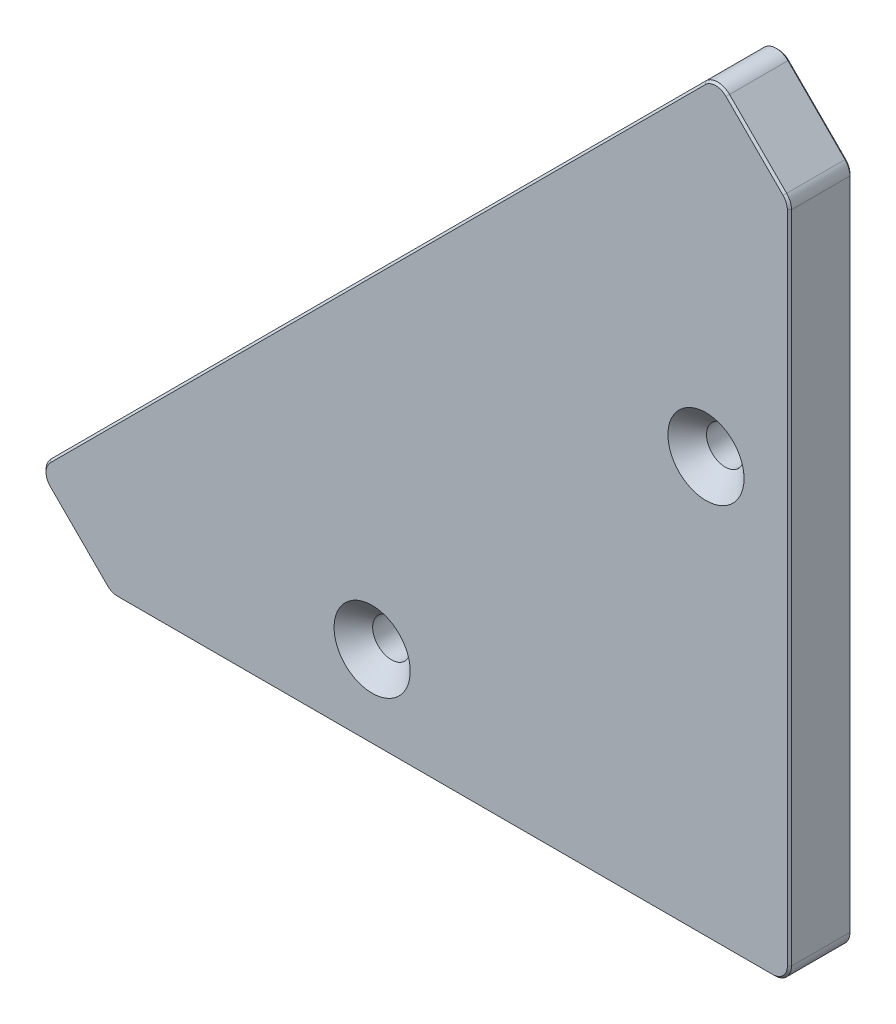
ISO-10303-21;
HEADER;
FILE_DESCRIPTION(('STEP AP214'),'2;1');
FILE_NAME('part.step','',(''),(''),'','','');
FILE_SCHEMA(('AUTOMOTIVE_DESIGN { 1 0 10303 214 1 1 1 1 }'));
ENDSEC;
DATA;
#1=APPLICATION_CONTEXT('core data for automotive mechanical design processes');
#2=APPLICATION_PROTOCOL_DEFINITION('international standard','automotive_design',2000,#1);
#3=PRODUCT_CONTEXT('',#1,'mechanical');
#4=PRODUCT('Part','Part','',(#3));
#5=PRODUCT_RELATED_PRODUCT_CATEGORY('part','',(#4));
#6=PRODUCT_DEFINITION_FORMATION('','',#4);
#7=PRODUCT_DEFINITION_CONTEXT('part definition',#1,'design');
#8=PRODUCT_DEFINITION('design','',#6,#7);
#9=PRODUCT_DEFINITION_SHAPE('','',#8);
#10=(LENGTH_UNIT() NAMED_UNIT(*) SI_UNIT(.MILLI.,.METRE.));
#11=(NAMED_UNIT(*) PLANE_ANGLE_UNIT() SI_UNIT($,.RADIAN.));
#12=(NAMED_UNIT(*) SI_UNIT($,.STERADIAN.) SOLID_ANGLE_UNIT());
#13=UNCERTAINTY_MEASURE_WITH_UNIT(LENGTH_MEASURE(1.E-05),#10,'distance_accuracy_value','');
#14=(GEOMETRIC_REPRESENTATION_CONTEXT(3) GLOBAL_UNCERTAINTY_ASSIGNED_CONTEXT((#13)) GLOBAL_UNIT_ASSIGNED_CONTEXT((#10,
#11,#12)) REPRESENTATION_CONTEXT('',''));
#15=CARTESIAN_POINT('',(0.,0.,0.));
#16=DIRECTION('',(0.,0.,1.));
#17=DIRECTION('',(1.,0.,0.));
#18=AXIS2_PLACEMENT_3D('',#15,#16,#17);
#19=CARTESIAN_POINT('',(0.,0.,15.));
#20=DIRECTION('',(0.,0.,-1.));
#21=DIRECTION('',(-1.,0.,0.));
#22=AXIS2_PLACEMENT_3D('',#19,#20,#21);
#23=PLANE('',#22);
#24=DIRECTION('',(-0.707106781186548,-0.707106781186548,0.));
#25=VECTOR('',#24,1.);
#26=CARTESIAN_POINT('',(-98.6413959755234,98.6413959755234,15.));
#27=LINE('',#26,#25);
#28=CARTESIAN_POINT('',(-20.1525432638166,177.13024868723,15.));
#29=VERTEX_POINT('',#28);
#30=CARTESIAN_POINT('',(-177.13024868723,20.1525432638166,15.));
#31=VERTEX_POINT('',#30);
#32=EDGE_CURVE('E369',#29,#31,#27,.T.);
#33=ORIENTED_EDGE('',*,*,#32,.T.);
#34=CARTESIAN_POINT('',(-174.655374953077,17.6776695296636,15.));
#35=DIRECTION('',(0.,0.,-1.));
#36=DIRECTION('',(-1.,0.,0.));
#37=AXIS2_PLACEMENT_3D('',#34,#35,#36);
#38=CIRCLE('',#37,3.50000000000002);
#39=CARTESIAN_POINT('',(-177.13024868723,15.2027957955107,15.));
#40=VERTEX_POINT('',#39);
#41=EDGE_CURVE('E377',#31,#40,#38,.F.);
#42=ORIENTED_EDGE('',*,*,#41,.T.);
#43=DIRECTION('',(0.707106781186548,-0.707106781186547,0.));
#44=VECTOR('',#43,1.);
#45=CARTESIAN_POINT('',(-80.9637264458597,-80.9637264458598,15.));
#46=LINE('',#45,#44);
#47=CARTESIAN_POINT('',(-163.452579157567,1.52512626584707,15.));
#48=VERTEX_POINT('',#47);
#49=EDGE_CURVE('E375',#40,#48,#46,.T.);
#50=ORIENTED_EDGE('',*,*,#49,.T.);
#51=CARTESIAN_POINT('',(-160.977705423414,4.,15.));
#52=DIRECTION('',(0.,0.,-1.));
#53=DIRECTION('',(-1.,0.,0.));
#54=AXIS2_PLACEMENT_3D('',#51,#52,#53);
#55=CIRCLE('',#54,3.50000000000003);
#56=CARTESIAN_POINT('',(-160.977705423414,0.499999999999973,15.));
#57=VERTEX_POINT('',#56);
#58=EDGE_CURVE('E367',#48,#57,#55,.F.);
#59=ORIENTED_EDGE('',*,*,#58,.T.);
#60=DIRECTION('',(1.,0.,0.));
#61=VECTOR('',#60,1.);
#62=CARTESIAN_POINT('',(0.,0.499999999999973,15.));
#63=LINE('',#62,#61);
#64=CARTESIAN_POINT('',(-4.,0.499999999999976,15.));
#65=VERTEX_POINT('',#64);
#66=EDGE_CURVE('E180',#57,#65,#63,.T.);
#67=ORIENTED_EDGE('',*,*,#66,.T.);
#68=CARTESIAN_POINT('',(-4.,4.,15.));
#69=DIRECTION('',(0.,0.,-1.));
#70=DIRECTION('',(-1.,0.,0.));
#71=AXIS2_PLACEMENT_3D('',#68,#69,#70);
#72=CIRCLE('',#71,3.50000000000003);
#73=CARTESIAN_POINT('',(-0.499999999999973,4.,15.));
#74=VERTEX_POINT('',#73);
#75=EDGE_CURVE('E174',#65,#74,#72,.F.);
#76=ORIENTED_EDGE('',*,*,#75,.T.);
#77=DIRECTION('',(0.,1.,0.));
#78=VECTOR('',#77,1.);
#79=CARTESIAN_POINT('',(-0.499999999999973,0.,15.));
#80=LINE('',#79,#78);
#81=CARTESIAN_POINT('',(-0.499999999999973,160.977705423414,15.));
#82=VERTEX_POINT('',#81);
#83=EDGE_CURVE('E177',#74,#82,#80,.T.);
#84=ORIENTED_EDGE('',*,*,#83,.T.);
#85=CARTESIAN_POINT('',(-4.,160.977705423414,15.));
#86=DIRECTION('',(0.,0.,-1.));
#87=DIRECTION('',(-1.,0.,0.));
#88=AXIS2_PLACEMENT_3D('',#85,#86,#87);
#89=CIRCLE('',#88,3.50000000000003);
#90=CARTESIAN_POINT('',(-1.52512626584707,163.452579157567,15.));
#91=VERTEX_POINT('',#90);
#92=EDGE_CURVE('E186',#82,#91,#89,.F.);
#93=ORIENTED_EDGE('',*,*,#92,.T.);
#94=DIRECTION('',(-0.707106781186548,0.707106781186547,0.));
#95=VECTOR('',#94,1.);
#96=CARTESIAN_POINT('',(80.9637264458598,80.9637264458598,15.));
#97=LINE('',#96,#95);
#98=CARTESIAN_POINT('',(-15.2027957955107,177.13024868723,15.));
#99=VERTEX_POINT('',#98);
#100=EDGE_CURVE('E185',#91,#99,#97,.T.);
#101=ORIENTED_EDGE('',*,*,#100,.T.);
#102=CARTESIAN_POINT('',(-17.6776695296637,174.655374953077,15.));
#103=DIRECTION('',(0.,0.,-1.));
#104=DIRECTION('',(-1.,0.,0.));
#105=AXIS2_PLACEMENT_3D('',#102,#103,#104);
#106=CIRCLE('',#105,3.50000000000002);
#107=EDGE_CURVE('E365',#99,#29,#106,.F.);
#108=ORIENTED_EDGE('',*,*,#107,.T.);
#109=EDGE_LOOP('',(#33,#42,#50,#59,#67,#76,#84,#93,#101,#108));
#110=FACE_BOUND('',#109,.T.);
#111=CARTESIAN_POINT('',(-20.,100.,15.));
#112=DIRECTION('',(0.,0.,1.));
#113=DIRECTION('',(1.,0.,0.));
#114=AXIS2_PLACEMENT_3D('',#111,#112,#113);
#115=CIRCLE('',#114,9.125);
#116=CARTESIAN_POINT('',(-10.875,100.,15.));
#117=VERTEX_POINT('',#116);
#118=EDGE_CURVE('E764',#117,#117,#115,.T.);
#119=ORIENTED_EDGE('',*,*,#118,.F.);
#120=EDGE_LOOP('',(#119));
#121=FACE_BOUND('',#120,.T.);
#122=CARTESIAN_POINT('',(-100.,20.,15.));
#123=DIRECTION('',(0.,0.,1.));
#124=DIRECTION('',(1.,0.,0.));
#125=AXIS2_PLACEMENT_3D('',#122,#123,#124);
#126=CIRCLE('',#125,9.12499999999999);
#127=CARTESIAN_POINT('',(-90.875,20.,15.));
#128=VERTEX_POINT('',#127);
#129=EDGE_CURVE('E203',#128,#128,#126,.T.);
#130=ORIENTED_EDGE('',*,*,#129,.F.);
#131=EDGE_LOOP('',(#130));
#132=FACE_BOUND('',#131,.T.);
#133=ADVANCED_FACE('F35',(#110,#121,#132),#23,.F.);
#134=CARTESIAN_POINT('',(0.,197.989898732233,15.));
#135=DIRECTION('',(-1.,0.,0.));
#136=DIRECTION('',(0.,0.,1.));
#137=AXIS2_PLACEMENT_3D('',#134,#135,#136);
#138=PLANE('',#137);
#139=DIRECTION('',(0.,0.,-1.));
#140=VECTOR('',#139,1.);
#141=CARTESIAN_POINT('',(0.,160.977705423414,15.));
#142=LINE('',#141,#140);
#143=CARTESIAN_POINT('',(0.,160.977705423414,0.499999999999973));
#144=VERTEX_POINT('',#143);
#145=CARTESIAN_POINT('',(0.,160.977705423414,14.5));
#146=VERTEX_POINT('',#145);
#147=EDGE_CURVE('E746',#144,#146,#142,.F.);
#148=ORIENTED_EDGE('',*,*,#147,.T.);
#149=DIRECTION('',(0.,-1.,0.));
#150=VECTOR('',#149,1.);
#151=CARTESIAN_POINT('',(0.,197.989898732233,14.5));
#152=LINE('',#151,#150);
#153=CARTESIAN_POINT('',(0.,4.,14.5));
#154=VERTEX_POINT('',#153);
#155=EDGE_CURVE('E292',#146,#154,#152,.T.);
#156=ORIENTED_EDGE('',*,*,#155,.T.);
#157=DIRECTION('',(0.,0.,-1.));
#158=VECTOR('',#157,1.);
#159=CARTESIAN_POINT('',(0.,4.,15.));
#160=LINE('',#159,#158);
#161=CARTESIAN_POINT('',(0.,4.,0.499999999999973));
#162=VERTEX_POINT('',#161);
#163=EDGE_CURVE('E748',#154,#162,#160,.T.);
#164=ORIENTED_EDGE('',*,*,#163,.T.);
#165=DIRECTION('',(0.,1.,0.));
#166=VECTOR('',#165,1.);
#167=CARTESIAN_POINT('',(0.,160.977705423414,0.499999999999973));
#168=LINE('',#167,#166);
#169=EDGE_CURVE('E290',#162,#144,#168,.T.);
#170=ORIENTED_EDGE('',*,*,#169,.T.);
#171=EDGE_LOOP('',(#148,#156,#164,#170));
#172=FACE_BOUND('',#171,.T.);
#173=ADVANCED_FACE('F415',(#172),#138,.F.);
#174=CARTESIAN_POINT('',(-197.989898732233,0.,15.));
#175=DIRECTION('',(0.707106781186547,-0.707106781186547,0.));
#176=DIRECTION('',(0.707106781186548,0.707106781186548,0.));
#177=AXIS2_PLACEMENT_3D('',#174,#175,#176);
#178=PLANE('',#177);
#179=DIRECTION('',(0.,0.,-1.));
#180=VECTOR('',#179,1.);
#181=CARTESIAN_POINT('',(-177.483802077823,20.5060966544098,15.));
#182=LINE('',#181,#180);
#183=CARTESIAN_POINT('',(-177.483802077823,20.5060966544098,0.499999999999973));
#184=VERTEX_POINT('',#183);
#185=CARTESIAN_POINT('',(-177.483802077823,20.5060966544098,14.5));
#186=VERTEX_POINT('',#185);
#187=EDGE_CURVE('E747',#184,#186,#182,.F.);
#188=ORIENTED_EDGE('',*,*,#187,.T.);
#189=DIRECTION('',(0.707106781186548,0.707106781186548,0.));
#190=VECTOR('',#189,1.);
#191=CARTESIAN_POINT('',(-197.989898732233,0.,14.5));
#192=LINE('',#191,#190);
#193=CARTESIAN_POINT('',(-20.5060966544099,177.483802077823,14.5));
#194=VERTEX_POINT('',#193);
#195=EDGE_CURVE('E326',#186,#194,#192,.T.);
#196=ORIENTED_EDGE('',*,*,#195,.T.);
#197=DIRECTION('',(0.,0.,-1.));
#198=VECTOR('',#197,1.);
#199=CARTESIAN_POINT('',(-20.5060966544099,177.483802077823,15.));
#200=LINE('',#199,#198);
#201=CARTESIAN_POINT('',(-20.5060966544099,177.483802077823,0.499999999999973));
#202=VERTEX_POINT('',#201);
#203=EDGE_CURVE('E346',#194,#202,#200,.T.);
#204=ORIENTED_EDGE('',*,*,#203,.T.);
#205=DIRECTION('',(-0.707106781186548,-0.707106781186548,0.));
#206=VECTOR('',#205,1.);
#207=CARTESIAN_POINT('',(-177.483802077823,20.5060966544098,0.499999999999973));
#208=LINE('',#207,#206);
#209=EDGE_CURVE('E321',#202,#184,#208,.T.);
#210=ORIENTED_EDGE('',*,*,#209,.T.);
#211=EDGE_LOOP('',(#188,#196,#204,#210));
#212=FACE_BOUND('',#211,.T.);
#213=ADVANCED_FACE('F420',(#212),#178,.F.);
#214=CARTESIAN_POINT('',(0.,0.,15.));
#215=DIRECTION('',(0.,1.,0.));
#216=DIRECTION('',(0.,0.,1.));
#217=AXIS2_PLACEMENT_3D('',#214,#215,#216);
#218=PLANE('',#217);
#219=DIRECTION('',(0.,0.,-1.));
#220=VECTOR('',#219,1.);
#221=CARTESIAN_POINT('',(-4.,0.,15.));
#222=LINE('',#221,#220);
#223=CARTESIAN_POINT('',(-4.,0.,0.499999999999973));
#224=VERTEX_POINT('',#223);
#225=CARTESIAN_POINT('',(-4.,0.,14.5));
#226=VERTEX_POINT('',#225);
#227=EDGE_CURVE('E736',#224,#226,#222,.F.);
#228=ORIENTED_EDGE('',*,*,#227,.T.);
#229=DIRECTION('',(-1.,0.,0.));
#230=VECTOR('',#229,1.);
#231=CARTESIAN_POINT('',(0.,0.,14.5));
#232=LINE('',#231,#230);
#233=CARTESIAN_POINT('',(-160.977705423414,0.,14.5));
#234=VERTEX_POINT('',#233);
#235=EDGE_CURVE('E267',#226,#234,#232,.T.);
#236=ORIENTED_EDGE('',*,*,#235,.T.);
#237=DIRECTION('',(0.,0.,-1.));
#238=VECTOR('',#237,1.);
#239=CARTESIAN_POINT('',(-160.977705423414,0.,15.));
#240=LINE('',#239,#238);
#241=CARTESIAN_POINT('',(-160.977705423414,0.,0.499999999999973));
#242=VERTEX_POINT('',#241);
#243=EDGE_CURVE('E197',#234,#242,#240,.T.);
#244=ORIENTED_EDGE('',*,*,#243,.T.);
#245=DIRECTION('',(1.,0.,0.));
#246=VECTOR('',#245,1.);
#247=CARTESIAN_POINT('',(-4.,0.,0.499999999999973));
#248=LINE('',#247,#246);
#249=EDGE_CURVE('E274',#242,#224,#248,.T.);
#250=ORIENTED_EDGE('',*,*,#249,.T.);
#251=EDGE_LOOP('',(#228,#236,#244,#250));
#252=FACE_BOUND('',#251,.T.);
#253=ADVANCED_FACE('F428',(#252),#218,.F.);
#254=CARTESIAN_POINT('',(0.,0.,0.));
#255=DIRECTION('',(0.,0.,-1.));
#256=DIRECTION('',(-1.,0.,0.));
#257=AXIS2_PLACEMENT_3D('',#254,#255,#256);
#258=PLANE('',#257);
#259=DIRECTION('',(-0.707106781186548,0.707106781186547,0.));
#260=VECTOR('',#259,1.);
#261=CARTESIAN_POINT('',(-177.13024868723,15.2027957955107,0.));
#262=LINE('',#261,#260);
#263=CARTESIAN_POINT('',(-163.452579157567,1.52512626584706,0.));
#264=VERTEX_POINT('',#263);
#265=CARTESIAN_POINT('',(-177.13024868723,15.2027957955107,0.));
#266=VERTEX_POINT('',#265);
#267=EDGE_CURVE('E44',#264,#266,#262,.T.);
#268=ORIENTED_EDGE('',*,*,#267,.T.);
#269=CARTESIAN_POINT('',(-174.655374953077,17.6776695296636,0.));
#270=DIRECTION('',(0.,0.,-1.));
#271=DIRECTION('',(-1.,0.,0.));
#272=AXIS2_PLACEMENT_3D('',#269,#270,#271);
#273=CIRCLE('',#272,3.50000000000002);
#274=CARTESIAN_POINT('',(-177.13024868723,20.1525432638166,0.));
#275=VERTEX_POINT('',#274);
#276=EDGE_CURVE('E11',#266,#275,#273,.T.);
#277=ORIENTED_EDGE('',*,*,#276,.T.);
#278=DIRECTION('',(0.707106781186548,0.707106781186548,0.));
#279=VECTOR('',#278,1.);
#280=CARTESIAN_POINT('',(-20.1525432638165,177.13024868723,0.));
#281=LINE('',#280,#279);
#282=CARTESIAN_POINT('',(-20.1525432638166,177.13024868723,0.));
#283=VERTEX_POINT('',#282);
#284=EDGE_CURVE('E308',#275,#283,#281,.T.);
#285=ORIENTED_EDGE('',*,*,#284,.T.);
#286=CARTESIAN_POINT('',(-17.6776695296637,174.655374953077,0.));
#287=DIRECTION('',(0.,0.,-1.));
#288=DIRECTION('',(-1.,0.,0.));
#289=AXIS2_PLACEMENT_3D('',#286,#287,#288);
#290=CIRCLE('',#289,3.50000000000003);
#291=CARTESIAN_POINT('',(-15.2027957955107,177.13024868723,0.));
#292=VERTEX_POINT('',#291);
#293=EDGE_CURVE('E304',#283,#292,#290,.T.);
#294=ORIENTED_EDGE('',*,*,#293,.T.);
#295=DIRECTION('',(0.707106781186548,-0.707106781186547,0.));
#296=VECTOR('',#295,1.);
#297=CARTESIAN_POINT('',(-1.52512626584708,163.452579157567,0.));
#298=LINE('',#297,#296);
#299=CARTESIAN_POINT('',(-1.52512626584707,163.452579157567,0.));
#300=VERTEX_POINT('',#299);
#301=EDGE_CURVE('E300',#292,#300,#298,.T.);
#302=ORIENTED_EDGE('',*,*,#301,.T.);
#303=CARTESIAN_POINT('',(-4.,160.977705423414,0.));
#304=DIRECTION('',(0.,0.,-1.));
#305=DIRECTION('',(-1.,0.,0.));
#306=AXIS2_PLACEMENT_3D('',#303,#304,#305);
#307=CIRCLE('',#306,3.50000000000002);
#308=CARTESIAN_POINT('',(-0.499999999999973,160.977705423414,0.));
#309=VERTEX_POINT('',#308);
#310=EDGE_CURVE('E296',#300,#309,#307,.T.);
#311=ORIENTED_EDGE('',*,*,#310,.T.);
#312=DIRECTION('',(0.,-1.,0.));
#313=VECTOR('',#312,1.);
#314=CARTESIAN_POINT('',(-0.499999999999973,4.,0.));
#315=LINE('',#314,#313);
#316=CARTESIAN_POINT('',(-0.499999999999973,4.,0.));
#317=VERTEX_POINT('',#316);
#318=EDGE_CURVE('E294',#309,#317,#315,.T.);
#319=ORIENTED_EDGE('',*,*,#318,.T.);
#320=CARTESIAN_POINT('',(-4.,4.,0.));
#321=DIRECTION('',(0.,0.,-1.));
#322=DIRECTION('',(-1.,0.,0.));
#323=AXIS2_PLACEMENT_3D('',#320,#321,#322);
#324=CIRCLE('',#323,3.50000000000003);
#325=CARTESIAN_POINT('',(-4.,0.499999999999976,0.));
#326=VERTEX_POINT('',#325);
#327=EDGE_CURVE('E298',#317,#326,#324,.T.);
#328=ORIENTED_EDGE('',*,*,#327,.T.);
#329=DIRECTION('',(-1.,0.,0.));
#330=VECTOR('',#329,1.);
#331=CARTESIAN_POINT('',(-160.977705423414,0.499999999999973,0.));
#332=LINE('',#331,#330);
#333=CARTESIAN_POINT('',(-160.977705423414,0.499999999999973,0.));
#334=VERTEX_POINT('',#333);
#335=EDGE_CURVE('E302',#326,#334,#332,.T.);
#336=ORIENTED_EDGE('',*,*,#335,.T.);
#337=CARTESIAN_POINT('',(-160.977705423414,4.,0.));
#338=DIRECTION('',(0.,0.,-1.));
#339=DIRECTION('',(-1.,0.,0.));
#340=AXIS2_PLACEMENT_3D('',#337,#338,#339);
#341=CIRCLE('',#340,3.50000000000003);
#342=EDGE_CURVE('E306',#334,#264,#341,.T.);
#343=ORIENTED_EDGE('',*,*,#342,.T.);
#344=EDGE_LOOP('',(#268,#277,#285,#294,#302,#311,#319,#328,#336,#343));
#345=FACE_BOUND('',#344,.T.);
#346=CARTESIAN_POINT('',(-100.,20.,0.));
#347=DIRECTION('',(0.,0.,1.));
#348=DIRECTION('',(1.,0.,0.));
#349=AXIS2_PLACEMENT_3D('',#346,#347,#348);
#350=CIRCLE('',#349,4.5);
#351=CARTESIAN_POINT('',(-95.5,20.,0.));
#352=VERTEX_POINT('',#351);
#353=EDGE_CURVE('E767',#352,#352,#350,.T.);
#354=ORIENTED_EDGE('',*,*,#353,.T.);
#355=EDGE_LOOP('',(#354));
#356=FACE_BOUND('',#355,.T.);
#357=CARTESIAN_POINT('',(-20.,100.,0.));
#358=DIRECTION('',(0.,0.,1.));
#359=DIRECTION('',(1.,0.,0.));
#360=AXIS2_PLACEMENT_3D('',#357,#358,#359);
#361=CIRCLE('',#360,4.5);
#362=CARTESIAN_POINT('',(-15.5,100.,0.));
#363=VERTEX_POINT('',#362);
#364=EDGE_CURVE('E356',#363,#363,#361,.T.);
#365=ORIENTED_EDGE('',*,*,#364,.T.);
#366=EDGE_LOOP('',(#365));
#367=FACE_BOUND('',#366,.T.);
#368=ADVANCED_FACE('F310',(#345,#356,#367),#258,.T.);
#369=CARTESIAN_POINT('',(-162.634559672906,0.,15.));
#370=DIRECTION('',(0.707106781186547,0.707106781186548,0.));
#371=DIRECTION('',(-0.707106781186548,0.707106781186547,0.));
#372=AXIS2_PLACEMENT_3D('',#369,#370,#371);
#373=PLANE('',#372);
#374=DIRECTION('',(0.,0.,-1.));
#375=VECTOR('',#374,1.);
#376=CARTESIAN_POINT('',(-163.80613254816,1.17157287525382,15.));
#377=LINE('',#376,#375);
#378=CARTESIAN_POINT('',(-163.80613254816,1.17157287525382,0.499999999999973));
#379=VERTEX_POINT('',#378);
#380=CARTESIAN_POINT('',(-163.80613254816,1.17157287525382,14.5));
#381=VERTEX_POINT('',#380);
#382=EDGE_CURVE('E391',#379,#381,#377,.F.);
#383=ORIENTED_EDGE('',*,*,#382,.T.);
#384=DIRECTION('',(-0.707106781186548,0.707106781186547,0.));
#385=VECTOR('',#384,1.);
#386=CARTESIAN_POINT('',(-162.634559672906,0.,14.5));
#387=LINE('',#386,#385);
#388=CARTESIAN_POINT('',(-177.483802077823,14.8492424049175,14.5));
#389=VERTEX_POINT('',#388);
#390=EDGE_CURVE('E327',#381,#389,#387,.T.);
#391=ORIENTED_EDGE('',*,*,#390,.T.);
#392=DIRECTION('',(0.,0.,-1.));
#393=VECTOR('',#392,1.);
#394=CARTESIAN_POINT('',(-177.483802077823,14.8492424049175,15.));
#395=LINE('',#394,#393);
#396=CARTESIAN_POINT('',(-177.483802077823,14.8492424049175,0.499999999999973));
#397=VERTEX_POINT('',#396);
#398=EDGE_CURVE('E394',#389,#397,#395,.T.);
#399=ORIENTED_EDGE('',*,*,#398,.T.);
#400=DIRECTION('',(0.707106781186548,-0.707106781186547,0.));
#401=VECTOR('',#400,1.);
#402=CARTESIAN_POINT('',(-163.80613254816,1.17157287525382,0.499999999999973));
#403=LINE('',#402,#401);
#404=EDGE_CURVE('E331',#397,#379,#403,.T.);
#405=ORIENTED_EDGE('',*,*,#404,.T.);
#406=EDGE_LOOP('',(#383,#391,#399,#405));
#407=FACE_BOUND('',#406,.T.);
#408=ADVANCED_FACE('F390',(#407),#373,.F.);
#409=CARTESIAN_POINT('',(0.,162.634559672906,15.));
#410=DIRECTION('',(-0.707106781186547,-0.707106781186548,0.));
#411=DIRECTION('',(0.707106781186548,-0.707106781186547,0.));
#412=AXIS2_PLACEMENT_3D('',#409,#410,#411);
#413=PLANE('',#412);
#414=DIRECTION('',(0.,0.,-1.));
#415=VECTOR('',#414,1.);
#416=CARTESIAN_POINT('',(-14.8492424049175,177.483802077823,15.));
#417=LINE('',#416,#415);
#418=CARTESIAN_POINT('',(-14.8492424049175,177.483802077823,0.499999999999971));
#419=VERTEX_POINT('',#418);
#420=CARTESIAN_POINT('',(-14.8492424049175,177.483802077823,14.5));
#421=VERTEX_POINT('',#420);
#422=EDGE_CURVE('E345',#419,#421,#417,.F.);
#423=ORIENTED_EDGE('',*,*,#422,.T.);
#424=DIRECTION('',(0.707106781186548,-0.707106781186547,0.));
#425=VECTOR('',#424,1.);
#426=CARTESIAN_POINT('',(0.,162.634559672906,14.5));
#427=LINE('',#426,#425);
#428=CARTESIAN_POINT('',(-1.17157287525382,163.80613254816,14.5));
#429=VERTEX_POINT('',#428);
#430=EDGE_CURVE('E276',#421,#429,#427,.T.);
#431=ORIENTED_EDGE('',*,*,#430,.T.);
#432=DIRECTION('',(0.,0.,-1.));
#433=VECTOR('',#432,1.);
#434=CARTESIAN_POINT('',(-1.17157287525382,163.80613254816,15.));
#435=LINE('',#434,#433);
#436=CARTESIAN_POINT('',(-1.17157287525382,163.80613254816,0.499999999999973));
#437=VERTEX_POINT('',#436);
#438=EDGE_CURVE('E355',#429,#437,#435,.T.);
#439=ORIENTED_EDGE('',*,*,#438,.T.);
#440=DIRECTION('',(-0.707106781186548,0.707106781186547,0.));
#441=VECTOR('',#440,1.);
#442=CARTESIAN_POINT('',(-14.8492424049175,177.483802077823,0.499999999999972));
#443=LINE('',#442,#441);
#444=EDGE_CURVE('E273',#437,#419,#443,.T.);
#445=ORIENTED_EDGE('',*,*,#444,.T.);
#446=EDGE_LOOP('',(#423,#431,#439,#445));
#447=FACE_BOUND('',#446,.T.);
#448=ADVANCED_FACE('F351',(#447),#413,.F.);
#449=CARTESIAN_POINT('',(-4.,160.977705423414,15.));
#450=DIRECTION('',(0.,0.,-1.));
#451=DIRECTION('',(-1.,0.,0.));
#452=AXIS2_PLACEMENT_3D('',#449,#450,#451);
#453=CYLINDRICAL_SURFACE('',#452,4.);
#454=ORIENTED_EDGE('',*,*,#438,.F.);
#455=CARTESIAN_POINT('',(-4.,160.977705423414,14.5));
#456=DIRECTION('',(0.,0.,-1.));
#457=DIRECTION('',(-1.,0.,0.));
#458=AXIS2_PLACEMENT_3D('',#455,#456,#457);
#459=CIRCLE('',#458,4.);
#460=EDGE_CURVE('E288',#429,#146,#459,.T.);
#461=ORIENTED_EDGE('',*,*,#460,.T.);
#462=ORIENTED_EDGE('',*,*,#147,.F.);
#463=CARTESIAN_POINT('',(-4.,160.977705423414,0.499999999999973));
#464=DIRECTION('',(0.,0.,-1.));
#465=DIRECTION('',(-1.,0.,0.));
#466=AXIS2_PLACEMENT_3D('',#463,#464,#465);
#467=CIRCLE('',#466,4.);
#468=EDGE_CURVE('E286',#144,#437,#467,.F.);
#469=ORIENTED_EDGE('',*,*,#468,.T.);
#470=EDGE_LOOP('',(#454,#461,#462,#469));
#471=FACE_BOUND('',#470,.T.);
#472=ADVANCED_FACE('F433',(#471),#453,.T.);
#473=CARTESIAN_POINT('',(-17.6776695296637,174.655374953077,15.));
#474=DIRECTION('',(0.,0.,-1.));
#475=DIRECTION('',(-1.,0.,0.));
#476=AXIS2_PLACEMENT_3D('',#473,#474,#475);
#477=CYLINDRICAL_SURFACE('',#476,4.);
#478=ORIENTED_EDGE('',*,*,#203,.F.);
#479=CARTESIAN_POINT('',(-17.6776695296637,174.655374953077,14.5));
#480=DIRECTION('',(0.,0.,-1.));
#481=DIRECTION('',(-1.,0.,0.));
#482=AXIS2_PLACEMENT_3D('',#479,#480,#481);
#483=CIRCLE('',#482,4.);
#484=EDGE_CURVE('E278',#194,#421,#483,.T.);
#485=ORIENTED_EDGE('',*,*,#484,.T.);
#486=ORIENTED_EDGE('',*,*,#422,.F.);
#487=CARTESIAN_POINT('',(-17.6776695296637,174.655374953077,0.499999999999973));
#488=DIRECTION('',(0.,0.,-1.));
#489=DIRECTION('',(-1.,0.,0.));
#490=AXIS2_PLACEMENT_3D('',#487,#488,#489);
#491=CIRCLE('',#490,4.);
#492=EDGE_CURVE('E338',#419,#202,#491,.F.);
#493=ORIENTED_EDGE('',*,*,#492,.T.);
#494=EDGE_LOOP('',(#478,#485,#486,#493));
#495=FACE_BOUND('',#494,.T.);
#496=ADVANCED_FACE('F344',(#495),#477,.T.);
#497=CARTESIAN_POINT('',(-174.655374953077,17.6776695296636,15.));
#498=DIRECTION('',(0.,0.,-1.));
#499=DIRECTION('',(-1.,0.,0.));
#500=AXIS2_PLACEMENT_3D('',#497,#498,#499);
#501=CYLINDRICAL_SURFACE('',#500,4.);
#502=ORIENTED_EDGE('',*,*,#398,.F.);
#503=CARTESIAN_POINT('',(-174.655374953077,17.6776695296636,14.5));
#504=DIRECTION('',(0.,0.,-1.));
#505=DIRECTION('',(-1.,0.,0.));
#506=AXIS2_PLACEMENT_3D('',#503,#504,#505);
#507=CIRCLE('',#506,4.);
#508=EDGE_CURVE('E383',#389,#186,#507,.T.);
#509=ORIENTED_EDGE('',*,*,#508,.T.);
#510=ORIENTED_EDGE('',*,*,#187,.F.);
#511=CARTESIAN_POINT('',(-174.655374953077,17.6776695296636,0.499999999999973));
#512=DIRECTION('',(0.,0.,-1.));
#513=DIRECTION('',(-1.,0.,0.));
#514=AXIS2_PLACEMENT_3D('',#511,#512,#513);
#515=CIRCLE('',#514,4.);
#516=EDGE_CURVE('E380',#184,#397,#515,.F.);
#517=ORIENTED_EDGE('',*,*,#516,.T.);
#518=EDGE_LOOP('',(#502,#509,#510,#517));
#519=FACE_BOUND('',#518,.T.);
#520=ADVANCED_FACE('F439',(#519),#501,.T.);
#521=CARTESIAN_POINT('',(-160.977705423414,4.,15.));
#522=DIRECTION('',(0.,0.,-1.));
#523=DIRECTION('',(-1.,0.,0.));
#524=AXIS2_PLACEMENT_3D('',#521,#522,#523);
#525=CYLINDRICAL_SURFACE('',#524,4.);
#526=ORIENTED_EDGE('',*,*,#243,.F.);
#527=CARTESIAN_POINT('',(-160.977705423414,4.,14.5));
#528=DIRECTION('',(0.,0.,-1.));
#529=DIRECTION('',(-1.,0.,0.));
#530=AXIS2_PLACEMENT_3D('',#527,#528,#529);
#531=CIRCLE('',#530,4.);
#532=EDGE_CURVE('E336',#234,#381,#531,.T.);
#533=ORIENTED_EDGE('',*,*,#532,.T.);
#534=ORIENTED_EDGE('',*,*,#382,.F.);
#535=CARTESIAN_POINT('',(-160.977705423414,4.,0.499999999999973));
#536=DIRECTION('',(0.,0.,-1.));
#537=DIRECTION('',(-1.,0.,0.));
#538=AXIS2_PLACEMENT_3D('',#535,#536,#537);
#539=CIRCLE('',#538,4.);
#540=EDGE_CURVE('E329',#379,#242,#539,.F.);
#541=ORIENTED_EDGE('',*,*,#540,.T.);
#542=EDGE_LOOP('',(#526,#533,#534,#541));
#543=FACE_BOUND('',#542,.T.);
#544=ADVANCED_FACE('F398',(#543),#525,.T.);
#545=CARTESIAN_POINT('',(-4.,4.,15.));
#546=DIRECTION('',(0.,0.,-1.));
#547=DIRECTION('',(-1.,0.,0.));
#548=AXIS2_PLACEMENT_3D('',#545,#546,#547);
#549=CYLINDRICAL_SURFACE('',#548,4.);
#550=ORIENTED_EDGE('',*,*,#163,.F.);
#551=CARTESIAN_POINT('',(-4.,4.,14.5));
#552=DIRECTION('',(0.,0.,-1.));
#553=DIRECTION('',(-1.,0.,0.));
#554=AXIS2_PLACEMENT_3D('',#551,#552,#553);
#555=CIRCLE('',#554,4.);
#556=EDGE_CURVE('E200',#154,#226,#555,.T.);
#557=ORIENTED_EDGE('',*,*,#556,.T.);
#558=ORIENTED_EDGE('',*,*,#227,.F.);
#559=CARTESIAN_POINT('',(-4.,4.,0.499999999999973));
#560=DIRECTION('',(0.,0.,-1.));
#561=DIRECTION('',(-1.,0.,0.));
#562=AXIS2_PLACEMENT_3D('',#559,#560,#561);
#563=CIRCLE('',#562,4.);
#564=EDGE_CURVE('E283',#224,#162,#563,.F.);
#565=ORIENTED_EDGE('',*,*,#564,.T.);
#566=EDGE_LOOP('',(#550,#557,#558,#565));
#567=FACE_BOUND('',#566,.T.);
#568=ADVANCED_FACE('F445',(#567),#549,.T.);
#569=CARTESIAN_POINT('',(-20.,100.,15.));
#570=DIRECTION('',(0.,0.,1.));
#571=DIRECTION('',(1.,0.,0.));
#572=AXIS2_PLACEMENT_3D('',#569,#570,#571);
#573=CYLINDRICAL_SURFACE('',#572,4.5);
#574=ORIENTED_EDGE('',*,*,#364,.F.);
#575=EDGE_LOOP('',(#574));
#576=FACE_BOUND('',#575,.T.);
#577=CARTESIAN_POINT('',(-20.,100.,10.375));
#578=DIRECTION('',(0.,0.,1.));
#579=DIRECTION('',(1.,0.,0.));
#580=AXIS2_PLACEMENT_3D('',#577,#578,#579);
#581=CIRCLE('',#580,4.5);
#582=CARTESIAN_POINT('',(-15.5,100.,10.375));
#583=VERTEX_POINT('',#582);
#584=EDGE_CURVE('E761',#583,#583,#581,.T.);
#585=ORIENTED_EDGE('',*,*,#584,.T.);
#586=EDGE_LOOP('',(#585));
#587=FACE_BOUND('',#586,.T.);
#588=ADVANCED_FACE('F448',(#576,#587),#573,.F.);
#589=CARTESIAN_POINT('',(-20.,100.,15.));
#590=DIRECTION('',(0.,0.,1.));
#591=DIRECTION('',(1.,0.,0.));
#592=AXIS2_PLACEMENT_3D('',#589,#590,#591);
#593=CONICAL_SURFACE('',#592,9.125,0.785398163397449);
#594=ORIENTED_EDGE('',*,*,#584,.F.);
#595=EDGE_LOOP('',(#594));
#596=FACE_BOUND('',#595,.T.);
#597=ORIENTED_EDGE('',*,*,#118,.T.);
#598=EDGE_LOOP('',(#597));
#599=FACE_BOUND('',#598,.T.);
#600=ADVANCED_FACE('F487',(#596,#599),#593,.F.);
#601=CARTESIAN_POINT('',(-100.,20.,15.));
#602=DIRECTION('',(0.,0.,1.));
#603=DIRECTION('',(1.,0.,0.));
#604=AXIS2_PLACEMENT_3D('',#601,#602,#603);
#605=CYLINDRICAL_SURFACE('',#604,4.5);
#606=ORIENTED_EDGE('',*,*,#353,.F.);
#607=EDGE_LOOP('',(#606));
#608=FACE_BOUND('',#607,.T.);
#609=CARTESIAN_POINT('',(-100.,20.,10.375));
#610=DIRECTION('',(0.,0.,1.));
#611=DIRECTION('',(1.,0.,0.));
#612=AXIS2_PLACEMENT_3D('',#609,#610,#611);
#613=CIRCLE('',#612,4.5);
#614=CARTESIAN_POINT('',(-95.5,20.,10.375));
#615=VERTEX_POINT('',#614);
#616=EDGE_CURVE('E770',#615,#615,#613,.T.);
#617=ORIENTED_EDGE('',*,*,#616,.T.);
#618=EDGE_LOOP('',(#617));
#619=FACE_BOUND('',#618,.T.);
#620=ADVANCED_FACE('F481',(#608,#619),#605,.F.);
#621=CARTESIAN_POINT('',(-100.,20.,15.));
#622=DIRECTION('',(0.,0.,1.));
#623=DIRECTION('',(1.,0.,0.));
#624=AXIS2_PLACEMENT_3D('',#621,#622,#623);
#625=CONICAL_SURFACE('',#624,9.12499999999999,0.785398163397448);
#626=ORIENTED_EDGE('',*,*,#616,.F.);
#627=EDGE_LOOP('',(#626));
#628=FACE_BOUND('',#627,.T.);
#629=ORIENTED_EDGE('',*,*,#129,.T.);
#630=EDGE_LOOP('',(#629));
#631=FACE_BOUND('',#630,.T.);
#632=ADVANCED_FACE('F477',(#628,#631),#625,.F.);
#633=CARTESIAN_POINT('',(-0.499999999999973,0.,15.));
#634=DIRECTION('',(-0.707106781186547,0.,-0.707106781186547));
#635=DIRECTION('',(0.,1.,0.));
#636=AXIS2_PLACEMENT_3D('',#633,#634,#635);
#637=PLANE('',#636);
#638=DIRECTION('',(-0.707106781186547,0.,0.707106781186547));
#639=VECTOR('',#638,1.);
#640=CARTESIAN_POINT('',(0.,4.,14.5));
#641=LINE('',#640,#639);
#642=EDGE_CURVE('E192',#154,#74,#641,.T.);
#643=ORIENTED_EDGE('',*,*,#642,.F.);
#644=ORIENTED_EDGE('',*,*,#155,.F.);
#645=DIRECTION('',(0.707106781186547,0.,-0.707106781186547));
#646=VECTOR('',#645,1.);
#647=CARTESIAN_POINT('',(-0.499999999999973,160.977705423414,15.));
#648=LINE('',#647,#646);
#649=EDGE_CURVE('E195',#82,#146,#648,.T.);
#650=ORIENTED_EDGE('',*,*,#649,.F.);
#651=ORIENTED_EDGE('',*,*,#83,.F.);
#652=EDGE_LOOP('',(#643,#644,#650,#651));
#653=FACE_BOUND('',#652,.T.);
#654=ADVANCED_FACE('F190',(#653),#637,.F.);
#655=CARTESIAN_POINT('',(-4.,160.977705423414,15.));
#656=DIRECTION('',(0.,0.,-1.));
#657=DIRECTION('',(-1.,0.,0.));
#658=AXIS2_PLACEMENT_3D('',#655,#656,#657);
#659=CONICAL_SURFACE('',#658,3.50000000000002,0.785398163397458);
#660=ORIENTED_EDGE('',*,*,#649,.T.);
#661=ORIENTED_EDGE('',*,*,#460,.F.);
#662=DIRECTION('',(0.500000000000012,0.499999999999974,-0.707106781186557));
#663=VECTOR('',#662,1.);
#664=CARTESIAN_POINT('',(-1.52512626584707,163.452579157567,15.));
#665=LINE('',#664,#663);
#666=EDGE_CURVE('E201',#91,#429,#665,.T.);
#667=ORIENTED_EDGE('',*,*,#666,.F.);
#668=ORIENTED_EDGE('',*,*,#92,.F.);
#669=EDGE_LOOP('',(#660,#661,#667,#668));
#670=FACE_BOUND('',#669,.T.);
#671=ADVANCED_FACE('F473',(#670),#659,.T.);
#672=CARTESIAN_POINT('',(-4.,4.,15.));
#673=DIRECTION('',(0.,0.,-1.));
#674=DIRECTION('',(-1.,0.,0.));
#675=AXIS2_PLACEMENT_3D('',#672,#673,#674);
#676=CONICAL_SURFACE('',#675,3.50000000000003,0.785398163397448);
#677=ORIENTED_EDGE('',*,*,#642,.T.);
#678=ORIENTED_EDGE('',*,*,#75,.F.);
#679=DIRECTION('',(0.,0.707106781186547,0.707106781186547));
#680=VECTOR('',#679,1.);
#681=CARTESIAN_POINT('',(-4.,0.,14.5));
#682=LINE('',#681,#680);
#683=EDGE_CURVE('E206',#226,#65,#682,.T.);
#684=ORIENTED_EDGE('',*,*,#683,.F.);
#685=ORIENTED_EDGE('',*,*,#556,.F.);
#686=EDGE_LOOP('',(#677,#678,#684,#685));
#687=FACE_BOUND('',#686,.T.);
#688=ADVANCED_FACE('F199',(#687),#676,.T.);
#689=CARTESIAN_POINT('',(80.9637264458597,80.9637264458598,15.));
#690=DIRECTION('',(-0.5,-0.5,-0.707106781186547));
#691=DIRECTION('',(-0.707106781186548,0.707106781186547,0.));
#692=AXIS2_PLACEMENT_3D('',#689,#690,#691);
#693=PLANE('',#692);
#694=ORIENTED_EDGE('',*,*,#666,.T.);
#695=ORIENTED_EDGE('',*,*,#430,.F.);
#696=DIRECTION('',(0.499999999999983,0.500000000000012,-0.707106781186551));
#697=VECTOR('',#696,1.);
#698=CARTESIAN_POINT('',(-15.2027957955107,177.13024868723,15.));
#699=LINE('',#698,#697);
#700=EDGE_CURVE('E261',#99,#421,#699,.T.);
#701=ORIENTED_EDGE('',*,*,#700,.F.);
#702=ORIENTED_EDGE('',*,*,#100,.F.);
#703=EDGE_LOOP('',(#694,#695,#701,#702));
#704=FACE_BOUND('',#703,.T.);
#705=ADVANCED_FACE('F360',(#704),#693,.F.);
#706=CARTESIAN_POINT('',(0.,0.499999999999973,15.));
#707=DIRECTION('',(0.,0.707106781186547,-0.707106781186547));
#708=DIRECTION('',(1.,0.,0.));
#709=AXIS2_PLACEMENT_3D('',#706,#707,#708);
#710=PLANE('',#709);
#711=ORIENTED_EDGE('',*,*,#683,.T.);
#712=ORIENTED_EDGE('',*,*,#66,.F.);
#713=DIRECTION('',(0.,0.707106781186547,0.707106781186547));
#714=VECTOR('',#713,1.);
#715=CARTESIAN_POINT('',(-160.977705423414,0.,14.5));
#716=LINE('',#715,#714);
#717=EDGE_CURVE('E258',#234,#57,#716,.T.);
#718=ORIENTED_EDGE('',*,*,#717,.F.);
#719=ORIENTED_EDGE('',*,*,#235,.F.);
#720=EDGE_LOOP('',(#711,#712,#718,#719));
#721=FACE_BOUND('',#720,.T.);
#722=ADVANCED_FACE('F265',(#721),#710,.F.);
#723=CARTESIAN_POINT('',(-17.6776695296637,174.655374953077,15.));
#724=DIRECTION('',(0.,0.,-1.));
#725=DIRECTION('',(-1.,0.,0.));
#726=AXIS2_PLACEMENT_3D('',#723,#724,#725);
#727=CONICAL_SURFACE('',#726,3.50000000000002,0.785398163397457);
#728=ORIENTED_EDGE('',*,*,#700,.T.);
#729=ORIENTED_EDGE('',*,*,#484,.F.);
#730=DIRECTION('',(-0.500000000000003,0.500000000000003,-0.707106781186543));
#731=VECTOR('',#730,1.);
#732=CARTESIAN_POINT('',(-20.1525432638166,177.13024868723,15.));
#733=LINE('',#732,#731);
#734=EDGE_CURVE('E255',#29,#194,#733,.T.);
#735=ORIENTED_EDGE('',*,*,#734,.F.);
#736=ORIENTED_EDGE('',*,*,#107,.F.);
#737=EDGE_LOOP('',(#728,#729,#735,#736));
#738=FACE_BOUND('',#737,.T.);
#739=ADVANCED_FACE('F364',(#738),#727,.T.);
#740=CARTESIAN_POINT('',(-160.977705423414,4.,15.));
#741=DIRECTION('',(0.,0.,-1.));
#742=DIRECTION('',(-1.,0.,0.));
#743=AXIS2_PLACEMENT_3D('',#740,#741,#742);
#744=CONICAL_SURFACE('',#743,3.50000000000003,0.785398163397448);
#745=ORIENTED_EDGE('',*,*,#717,.T.);
#746=ORIENTED_EDGE('',*,*,#58,.F.);
#747=DIRECTION('',(0.499999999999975,0.500000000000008,0.707106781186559));
#748=VECTOR('',#747,1.);
#749=CARTESIAN_POINT('',(-163.80613254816,1.17157287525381,14.5));
#750=LINE('',#749,#748);
#751=EDGE_CURVE('E249',#381,#48,#750,.T.);
#752=ORIENTED_EDGE('',*,*,#751,.F.);
#753=ORIENTED_EDGE('',*,*,#532,.F.);
#754=EDGE_LOOP('',(#745,#746,#752,#753));
#755=FACE_BOUND('',#754,.T.);
#756=ADVANCED_FACE('F460',(#755),#744,.T.);
#757=CARTESIAN_POINT('',(-98.6413959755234,98.6413959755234,15.));
#758=DIRECTION('',(0.500000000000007,-0.500000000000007,-0.707106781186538));
#759=DIRECTION('',(-0.707106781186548,-0.707106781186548,0.));
#760=AXIS2_PLACEMENT_3D('',#757,#758,#759);
#761=PLANE('',#760);
#762=ORIENTED_EDGE('',*,*,#734,.T.);
#763=ORIENTED_EDGE('',*,*,#195,.F.);
#764=DIRECTION('',(-0.500000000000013,0.500000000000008,-0.707106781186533));
#765=VECTOR('',#764,1.);
#766=CARTESIAN_POINT('',(-177.13024868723,20.1525432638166,15.));
#767=LINE('',#766,#765);
#768=EDGE_CURVE('E242',#31,#186,#767,.T.);
#769=ORIENTED_EDGE('',*,*,#768,.F.);
#770=ORIENTED_EDGE('',*,*,#32,.F.);
#771=EDGE_LOOP('',(#762,#763,#769,#770));
#772=FACE_BOUND('',#771,.T.);
#773=ADVANCED_FACE('F456',(#772),#761,.F.);
#774=CARTESIAN_POINT('',(-80.9637264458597,-80.9637264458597,15.));
#775=DIRECTION('',(0.5,0.5,-0.707106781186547));
#776=DIRECTION('',(0.707106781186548,-0.707106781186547,0.));
#777=AXIS2_PLACEMENT_3D('',#774,#775,#776);
#778=PLANE('',#777);
#779=ORIENTED_EDGE('',*,*,#751,.T.);
#780=ORIENTED_EDGE('',*,*,#49,.F.);
#781=DIRECTION('',(0.500000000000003,0.500000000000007,0.70710678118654));
#782=VECTOR('',#781,1.);
#783=CARTESIAN_POINT('',(-177.483802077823,14.8492424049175,14.5));
#784=LINE('',#783,#782);
#785=EDGE_CURVE('E237',#389,#40,#784,.T.);
#786=ORIENTED_EDGE('',*,*,#785,.F.);
#787=ORIENTED_EDGE('',*,*,#390,.F.);
#788=EDGE_LOOP('',(#779,#780,#786,#787));
#789=FACE_BOUND('',#788,.T.);
#790=ADVANCED_FACE('F453',(#789),#778,.F.);
#791=CARTESIAN_POINT('',(-174.655374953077,17.6776695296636,15.));
#792=DIRECTION('',(0.,0.,-1.));
#793=DIRECTION('',(-1.,0.,0.));
#794=AXIS2_PLACEMENT_3D('',#791,#792,#793);
#795=CONICAL_SURFACE('',#794,3.50000000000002,0.785398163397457);
#796=ORIENTED_EDGE('',*,*,#768,.T.);
#797=ORIENTED_EDGE('',*,*,#508,.F.);
#798=ORIENTED_EDGE('',*,*,#785,.T.);
#799=ORIENTED_EDGE('',*,*,#41,.F.);
#800=EDGE_LOOP('',(#796,#797,#798,#799));
#801=FACE_BOUND('',#800,.T.);
#802=ADVANCED_FACE('F450',(#801),#795,.T.);
#803=CARTESIAN_POINT('',(0.,197.989898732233,0.499999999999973));
#804=DIRECTION('',(0.707106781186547,0.,-0.707106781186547));
#805=DIRECTION('',(0.,-1.,0.));
#806=AXIS2_PLACEMENT_3D('',#803,#804,#805);
#807=PLANE('',#806);
#808=DIRECTION('',(-0.707106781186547,0.,-0.707106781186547));
#809=VECTOR('',#808,1.);
#810=CARTESIAN_POINT('',(0.,160.977705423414,0.499999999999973));
#811=LINE('',#810,#809);
#812=EDGE_CURVE('E230',#144,#309,#811,.T.);
#813=ORIENTED_EDGE('',*,*,#812,.F.);
#814=ORIENTED_EDGE('',*,*,#169,.F.);
#815=DIRECTION('',(0.707106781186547,0.,0.707106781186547));
#816=VECTOR('',#815,1.);
#817=CARTESIAN_POINT('',(-0.499999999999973,4.,0.));
#818=LINE('',#817,#816);
#819=EDGE_CURVE('E39',#317,#162,#818,.T.);
#820=ORIENTED_EDGE('',*,*,#819,.F.);
#821=ORIENTED_EDGE('',*,*,#318,.F.);
#822=EDGE_LOOP('',(#813,#814,#820,#821));
#823=FACE_BOUND('',#822,.T.);
#824=ADVANCED_FACE('F37',(#823),#807,.T.);
#825=CARTESIAN_POINT('',(-4.,4.,0.));
#826=DIRECTION('',(0.,0.,1.));
#827=DIRECTION('',(1.,0.,0.));
#828=AXIS2_PLACEMENT_3D('',#825,#826,#827);
#829=CONICAL_SURFACE('',#828,3.50000000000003,0.785398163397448);
#830=ORIENTED_EDGE('',*,*,#819,.T.);
#831=ORIENTED_EDGE('',*,*,#564,.F.);
#832=DIRECTION('',(0.,-0.707106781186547,0.707106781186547));
#833=VECTOR('',#832,1.);
#834=CARTESIAN_POINT('',(-4.,0.499999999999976,0.));
#835=LINE('',#834,#833);
#836=EDGE_CURVE('E228',#326,#224,#835,.T.);
#837=ORIENTED_EDGE('',*,*,#836,.F.);
#838=ORIENTED_EDGE('',*,*,#327,.F.);
#839=EDGE_LOOP('',(#830,#831,#837,#838));
#840=FACE_BOUND('',#839,.T.);
#841=ADVANCED_FACE('F655',(#840),#829,.T.);
#842=CARTESIAN_POINT('',(-4.,160.977705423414,0.));
#843=DIRECTION('',(0.,0.,1.));
#844=DIRECTION('',(1.,0.,0.));
#845=AXIS2_PLACEMENT_3D('',#842,#843,#844);
#846=CONICAL_SURFACE('',#845,3.50000000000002,0.785398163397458);
#847=ORIENTED_EDGE('',*,*,#812,.T.);
#848=ORIENTED_EDGE('',*,*,#310,.F.);
#849=DIRECTION('',(-0.500000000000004,-0.500000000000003,-0.707106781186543));
#850=VECTOR('',#849,1.);
#851=CARTESIAN_POINT('',(-1.17157287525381,163.80613254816,0.499999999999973));
#852=LINE('',#851,#850);
#853=EDGE_CURVE('E225',#437,#300,#852,.T.);
#854=ORIENTED_EDGE('',*,*,#853,.F.);
#855=ORIENTED_EDGE('',*,*,#468,.F.);
#856=EDGE_LOOP('',(#847,#848,#854,#855));
#857=FACE_BOUND('',#856,.T.);
#858=ADVANCED_FACE('F664',(#857),#846,.T.);
#859=CARTESIAN_POINT('',(0.,0.,0.499999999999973));
#860=DIRECTION('',(0.,-0.707106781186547,-0.707106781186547));
#861=DIRECTION('',(-1.,0.,0.));
#862=AXIS2_PLACEMENT_3D('',#859,#860,#861);
#863=PLANE('',#862);
#864=ORIENTED_EDGE('',*,*,#836,.T.);
#865=ORIENTED_EDGE('',*,*,#249,.F.);
#866=DIRECTION('',(0.,-0.707106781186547,0.707106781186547));
#867=VECTOR('',#866,1.);
#868=CARTESIAN_POINT('',(-160.977705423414,0.499999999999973,0.));
#869=LINE('',#868,#867);
#870=EDGE_CURVE('E222',#334,#242,#869,.T.);
#871=ORIENTED_EDGE('',*,*,#870,.F.);
#872=ORIENTED_EDGE('',*,*,#335,.F.);
#873=EDGE_LOOP('',(#864,#865,#871,#872));
#874=FACE_BOUND('',#873,.T.);
#875=ADVANCED_FACE('F672',(#874),#863,.T.);
#876=CARTESIAN_POINT('',(0.,162.634559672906,0.499999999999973));
#877=DIRECTION('',(0.5,0.5,-0.707106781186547));
#878=DIRECTION('',(0.707106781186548,-0.707106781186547,0.));
#879=AXIS2_PLACEMENT_3D('',#876,#877,#878);
#880=PLANE('',#879);
#881=ORIENTED_EDGE('',*,*,#853,.T.);
#882=ORIENTED_EDGE('',*,*,#301,.F.);
#883=DIRECTION('',(-0.500000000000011,-0.500000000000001,-0.707106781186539));
#884=VECTOR('',#883,1.);
#885=CARTESIAN_POINT('',(-14.8492424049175,177.483802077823,0.499999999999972));
#886=LINE('',#885,#884);
#887=EDGE_CURVE('E219',#419,#292,#886,.T.);
#888=ORIENTED_EDGE('',*,*,#887,.F.);
#889=ORIENTED_EDGE('',*,*,#444,.F.);
#890=EDGE_LOOP('',(#881,#882,#888,#889));
#891=FACE_BOUND('',#890,.T.);
#892=ADVANCED_FACE('F681',(#891),#880,.T.);
#893=CARTESIAN_POINT('',(-160.977705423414,4.,0.));
#894=DIRECTION('',(0.,0.,1.));
#895=DIRECTION('',(1.,0.,0.));
#896=AXIS2_PLACEMENT_3D('',#893,#894,#895);
#897=CONICAL_SURFACE('',#896,3.50000000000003,0.785398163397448);
#898=ORIENTED_EDGE('',*,*,#870,.T.);
#899=ORIENTED_EDGE('',*,*,#540,.F.);
#900=DIRECTION('',(-0.499999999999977,-0.500000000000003,0.707106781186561));
#901=VECTOR('',#900,1.);
#902=CARTESIAN_POINT('',(-163.452579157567,1.52512626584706,0.));
#903=LINE('',#902,#901);
#904=EDGE_CURVE('E216',#264,#379,#903,.T.);
#905=ORIENTED_EDGE('',*,*,#904,.F.);
#906=ORIENTED_EDGE('',*,*,#342,.F.);
#907=EDGE_LOOP('',(#898,#899,#905,#906));
#908=FACE_BOUND('',#907,.T.);
#909=ADVANCED_FACE('F402',(#908),#897,.T.);
#910=CARTESIAN_POINT('',(-17.6776695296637,174.655374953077,0.));
#911=DIRECTION('',(0.,0.,1.));
#912=DIRECTION('',(1.,0.,0.));
#913=AXIS2_PLACEMENT_3D('',#910,#911,#912);
#914=CONICAL_SURFACE('',#913,3.50000000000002,0.785398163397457);
#915=ORIENTED_EDGE('',*,*,#887,.T.);
#916=ORIENTED_EDGE('',*,*,#293,.F.);
#917=DIRECTION('',(0.500000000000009,-0.499999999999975,-0.707106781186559));
#918=VECTOR('',#917,1.);
#919=CARTESIAN_POINT('',(-20.5060966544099,177.483802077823,0.499999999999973));
#920=LINE('',#919,#918);
#921=EDGE_CURVE('E213',#202,#283,#920,.T.);
#922=ORIENTED_EDGE('',*,*,#921,.F.);
#923=ORIENTED_EDGE('',*,*,#492,.F.);
#924=EDGE_LOOP('',(#915,#916,#922,#923));
#925=FACE_BOUND('',#924,.T.);
#926=ADVANCED_FACE('F316',(#925),#914,.T.);
#927=CARTESIAN_POINT('',(-162.634559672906,0.,0.499999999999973));
#928=DIRECTION('',(-0.5,-0.5,-0.707106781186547));
#929=DIRECTION('',(-0.707106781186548,0.707106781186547,0.));
#930=AXIS2_PLACEMENT_3D('',#927,#928,#929);
#931=PLANE('',#930);
#932=ORIENTED_EDGE('',*,*,#904,.T.);
#933=ORIENTED_EDGE('',*,*,#404,.F.);
#934=DIRECTION('',(-0.500000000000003,-0.500000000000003,0.707106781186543));
#935=VECTOR('',#934,1.);
#936=CARTESIAN_POINT('',(-177.13024868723,15.2027957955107,0.));
#937=LINE('',#936,#935);
#938=EDGE_CURVE('E211',#266,#397,#937,.T.);
#939=ORIENTED_EDGE('',*,*,#938,.F.);
#940=ORIENTED_EDGE('',*,*,#267,.F.);
#941=EDGE_LOOP('',(#932,#933,#939,#940));
#942=FACE_BOUND('',#941,.T.);
#943=ADVANCED_FACE('F405',(#942),#931,.T.);
#944=CARTESIAN_POINT('',(-197.989898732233,0.,0.499999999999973));
#945=DIRECTION('',(-0.499999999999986,0.499999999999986,-0.707106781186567));
#946=DIRECTION('',(0.707106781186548,0.707106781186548,0.));
#947=AXIS2_PLACEMENT_3D('',#944,#945,#946);
#948=PLANE('',#947);
#949=ORIENTED_EDGE('',*,*,#921,.T.);
#950=ORIENTED_EDGE('',*,*,#284,.F.);
#951=DIRECTION('',(0.500000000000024,-0.500000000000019,-0.707106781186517));
#952=VECTOR('',#951,1.);
#953=CARTESIAN_POINT('',(-177.483802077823,20.5060966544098,0.499999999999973));
#954=LINE('',#953,#952);
#955=EDGE_CURVE('E58',#184,#275,#954,.T.);
#956=ORIENTED_EDGE('',*,*,#955,.F.);
#957=ORIENTED_EDGE('',*,*,#209,.F.);
#958=EDGE_LOOP('',(#949,#950,#956,#957));
#959=FACE_BOUND('',#958,.T.);
#960=ADVANCED_FACE('F320',(#959),#948,.T.);
#961=CARTESIAN_POINT('',(-174.655374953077,17.6776695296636,0.));
#962=DIRECTION('',(0.,0.,1.));
#963=DIRECTION('',(1.,0.,0.));
#964=AXIS2_PLACEMENT_3D('',#961,#962,#963);
#965=CONICAL_SURFACE('',#964,3.50000000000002,0.785398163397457);
#966=ORIENTED_EDGE('',*,*,#938,.T.);
#967=ORIENTED_EDGE('',*,*,#516,.F.);
#968=ORIENTED_EDGE('',*,*,#955,.T.);
#969=ORIENTED_EDGE('',*,*,#276,.F.);
#970=EDGE_LOOP('',(#966,#967,#968,#969));
#971=FACE_BOUND('',#970,.T.);
#972=ADVANCED_FACE('F406',(#971),#965,.T.);
#973=CLOSED_SHELL('',(#133,#173,#213,#253,#368,#408,#448,#472,#496,#520,#544,#568,#588,#600,
#620,#632,#654,#671,#688,#705,#722,#739,#756,#773,#790,#802,#824,#841,#858,#875,#892,#909,#926,
#943,#960,#972));
#974=MANIFOLD_SOLID_BREP('B2',#973);
#975=ADVANCED_BREP_SHAPE_REPRESENTATION('',(#18,#974),#14);
#976=SHAPE_DEFINITION_REPRESENTATION(#9,#975);
ENDSEC;
END-ISO-10303-21;
